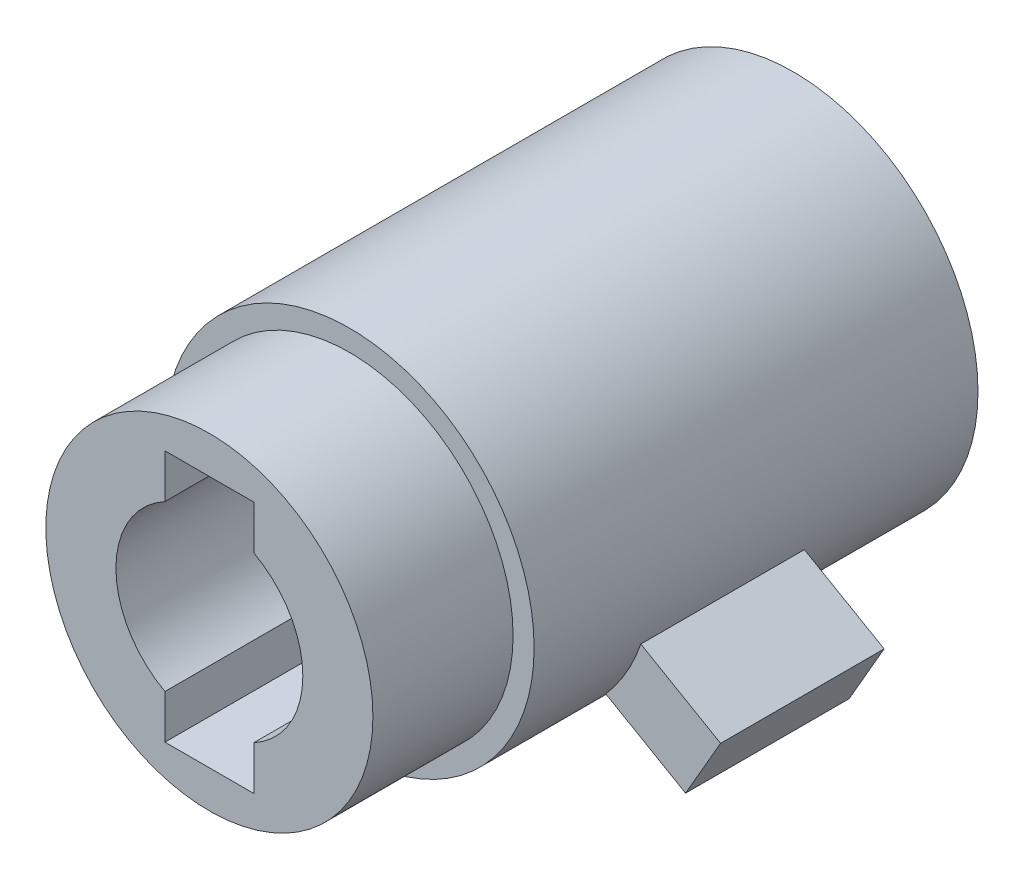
ISO-10303-21;
HEADER;
FILE_DESCRIPTION(('STEP AP214'),'2;1');
FILE_NAME('part.step','',(''),(''),'','','');
FILE_SCHEMA(('AUTOMOTIVE_DESIGN { 1 0 10303 214 1 1 1 1 }'));
ENDSEC;
DATA;
#1=APPLICATION_CONTEXT('core data for automotive mechanical design processes');
#2=APPLICATION_PROTOCOL_DEFINITION('international standard','automotive_design',2000,#1);
#3=PRODUCT_CONTEXT('',#1,'mechanical');
#4=PRODUCT('Part','Part','',(#3));
#5=PRODUCT_RELATED_PRODUCT_CATEGORY('part','',(#4));
#6=PRODUCT_DEFINITION_FORMATION('','',#4);
#7=PRODUCT_DEFINITION_CONTEXT('part definition',#1,'design');
#8=PRODUCT_DEFINITION('design','',#6,#7);
#9=PRODUCT_DEFINITION_SHAPE('','',#8);
#10=(LENGTH_UNIT() NAMED_UNIT(*) SI_UNIT(.MILLI.,.METRE.));
#11=(NAMED_UNIT(*) PLANE_ANGLE_UNIT() SI_UNIT($,.RADIAN.));
#12=(NAMED_UNIT(*) SI_UNIT($,.STERADIAN.) SOLID_ANGLE_UNIT());
#13=UNCERTAINTY_MEASURE_WITH_UNIT(LENGTH_MEASURE(1.E-05),#10,'distance_accuracy_value','');
#14=(GEOMETRIC_REPRESENTATION_CONTEXT(3) GLOBAL_UNCERTAINTY_ASSIGNED_CONTEXT((#13)) GLOBAL_UNIT_ASSIGNED_CONTEXT((#10,
#11,#12)) REPRESENTATION_CONTEXT('',''));
#15=CARTESIAN_POINT('',(0.,0.,0.));
#16=DIRECTION('',(0.,0.,1.));
#17=DIRECTION('',(1.,0.,0.));
#18=AXIS2_PLACEMENT_3D('',#15,#16,#17);
#19=CARTESIAN_POINT('',(0.,0.,-3.3));
#20=DIRECTION('',(0.,0.,1.));
#21=DIRECTION('',(1.,0.,0.));
#22=AXIS2_PLACEMENT_3D('',#19,#20,#21);
#23=CYLINDRICAL_SURFACE('',#22,3.95);
#24=DIRECTION('',(0.,0.,1.));
#25=VECTOR('',#24,1.);
#26=CARTESIAN_POINT('',(-3.73357112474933,-1.28955289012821,3.1));
#27=LINE('',#26,#25);
#28=CARTESIAN_POINT('',(-3.73357112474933,-1.28955289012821,3.1));
#29=VERTEX_POINT('',#28);
#30=CARTESIAN_POINT('',(-3.73357112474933,-1.28955289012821,6.2));
#31=VERTEX_POINT('',#30);
#32=EDGE_CURVE('E205',#29,#31,#27,.T.);
#33=ORIENTED_EDGE('',*,*,#32,.T.);
#34=CARTESIAN_POINT('',(0.,0.,6.2));
#35=DIRECTION('',(0.,0.,1.));
#36=DIRECTION('',(1.,0.,0.));
#37=AXIS2_PLACEMENT_3D('',#34,#35,#36);
#38=CIRCLE('',#37,3.95);
#39=CARTESIAN_POINT('',(-2.98357112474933,-2.58859099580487,6.2));
#40=VERTEX_POINT('',#39);
#41=EDGE_CURVE('E246',#40,#31,#38,.T.);
#42=ORIENTED_EDGE('',*,*,#41,.F.);
#43=DIRECTION('',(0.,0.,1.));
#44=VECTOR('',#43,1.);
#45=CARTESIAN_POINT('',(-2.98357112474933,-2.58859099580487,3.1));
#46=LINE('',#45,#44);
#47=CARTESIAN_POINT('',(-2.98357112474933,-2.58859099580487,3.1));
#48=VERTEX_POINT('',#47);
#49=EDGE_CURVE('E181',#48,#40,#46,.T.);
#50=ORIENTED_EDGE('',*,*,#49,.F.);
#51=CARTESIAN_POINT('',(0.,0.,3.1));
#52=DIRECTION('',(0.,0.,-1.));
#53=DIRECTION('',(1.,0.,0.));
#54=AXIS2_PLACEMENT_3D('',#51,#52,#53);
#55=CIRCLE('',#54,3.95);
#56=EDGE_CURVE('E197',#48,#29,#55,.T.);
#57=ORIENTED_EDGE('',*,*,#56,.T.);
#58=EDGE_LOOP('',(#33,#42,#50,#57));
#59=FACE_BOUND('',#58,.T.);
#60=CARTESIAN_POINT('',(0.,0.,-3.3));
#61=DIRECTION('',(0.,0.,1.));
#62=DIRECTION('',(1.,0.,0.));
#63=AXIS2_PLACEMENT_3D('',#60,#61,#62);
#64=CIRCLE('',#63,3.95);
#65=CARTESIAN_POINT('',(3.95,0.,-3.3));
#66=VERTEX_POINT('',#65);
#67=EDGE_CURVE('E248',#66,#66,#64,.T.);
#68=ORIENTED_EDGE('',*,*,#67,.T.);
#69=EDGE_LOOP('',(#68));
#70=FACE_BOUND('',#69,.T.);
#71=DIRECTION('',(0.,0.,1.));
#72=VECTOR('',#71,1.);
#73=CARTESIAN_POINT('',(3.73357112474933,-1.28955289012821,0.2));
#74=LINE('',#73,#72);
#75=CARTESIAN_POINT('',(3.73357112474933,-1.28955289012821,0.2));
#76=VERTEX_POINT('',#75);
#77=CARTESIAN_POINT('',(3.73357112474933,-1.28955289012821,3.7));
#78=VERTEX_POINT('',#77);
#79=EDGE_CURVE('E50',#76,#78,#74,.T.);
#80=ORIENTED_EDGE('',*,*,#79,.F.);
#81=CARTESIAN_POINT('',(0.,0.,0.2));
#82=DIRECTION('',(0.,0.,-1.));
#83=DIRECTION('',(1.,0.,0.));
#84=AXIS2_PLACEMENT_3D('',#81,#82,#83);
#85=CIRCLE('',#84,3.95);
#86=CARTESIAN_POINT('',(2.98357112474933,-2.58859099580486,0.2));
#87=VERTEX_POINT('',#86);
#88=EDGE_CURVE('E220',#76,#87,#85,.T.);
#89=ORIENTED_EDGE('',*,*,#88,.T.);
#90=DIRECTION('',(0.,0.,1.));
#91=VECTOR('',#90,1.);
#92=CARTESIAN_POINT('',(2.98357112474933,-2.58859099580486,0.2));
#93=LINE('',#92,#91);
#94=CARTESIAN_POINT('',(2.98357112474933,-2.58859099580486,3.7));
#95=VERTEX_POINT('',#94);
#96=EDGE_CURVE('E231',#87,#95,#93,.T.);
#97=ORIENTED_EDGE('',*,*,#96,.T.);
#98=CARTESIAN_POINT('',(0.,0.,3.7));
#99=DIRECTION('',(0.,0.,-1.));
#100=DIRECTION('',(1.,0.,0.));
#101=AXIS2_PLACEMENT_3D('',#98,#99,#100);
#102=CIRCLE('',#101,3.95);
#103=EDGE_CURVE('E204',#78,#95,#102,.T.);
#104=ORIENTED_EDGE('',*,*,#103,.F.);
#105=EDGE_LOOP('',(#80,#89,#97,#104));
#106=FACE_BOUND('',#105,.T.);
#107=ADVANCED_FACE('F27',(#59,#70,#106),#23,.T.);
#108=CARTESIAN_POINT('',(0.,0.,0.));
#109=DIRECTION('',(0.,0.,1.));
#110=DIRECTION('',(1.,0.,0.));
#111=AXIS2_PLACEMENT_3D('',#108,#109,#110);
#112=PLANE('',#111);
#113=CARTESIAN_POINT('',(0.,0.,0.));
#114=DIRECTION('',(0.,0.,1.));
#115=DIRECTION('',(1.,0.,0.));
#116=AXIS2_PLACEMENT_3D('',#113,#114,#115);
#117=CIRCLE('',#116,2.7);
#118=CARTESIAN_POINT('',(-0.95,2.52735039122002,0.));
#119=VERTEX_POINT('',#118);
#120=CARTESIAN_POINT('',(-0.95,-2.52735039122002,0.));
#121=VERTEX_POINT('',#120);
#122=EDGE_CURVE('E254',#119,#121,#117,.T.);
#123=ORIENTED_EDGE('',*,*,#122,.F.);
#124=DIRECTION('',(0.,-1.,0.));
#125=VECTOR('',#124,1.);
#126=CARTESIAN_POINT('',(-0.95,2.7,0.));
#127=LINE('',#126,#125);
#128=CARTESIAN_POINT('',(-0.95,1.7599715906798,0.));
#129=VERTEX_POINT('',#128);
#130=EDGE_CURVE('E281',#119,#129,#127,.T.);
#131=ORIENTED_EDGE('',*,*,#130,.T.);
#132=CARTESIAN_POINT('',(0.,0.,0.));
#133=DIRECTION('',(0.,0.,1.));
#134=DIRECTION('',(1.,0.,0.));
#135=AXIS2_PLACEMENT_3D('',#132,#133,#134);
#136=CIRCLE('',#135,2.);
#137=CARTESIAN_POINT('',(-0.95,-1.7599715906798,0.));
#138=VERTEX_POINT('',#137);
#139=EDGE_CURVE('E283',#129,#138,#136,.T.);
#140=ORIENTED_EDGE('',*,*,#139,.T.);
#141=DIRECTION('',(0.,-1.,0.));
#142=VECTOR('',#141,1.);
#143=CARTESIAN_POINT('',(-0.95,-2.7,0.));
#144=LINE('',#143,#142);
#145=EDGE_CURVE('E286',#138,#121,#144,.T.);
#146=ORIENTED_EDGE('',*,*,#145,.T.);
#147=EDGE_LOOP('',(#123,#131,#140,#146));
#148=FACE_BOUND('',#147,.T.);
#149=ADVANCED_FACE('F405',(#148),#112,.F.);
#150=CARTESIAN_POINT('',(0.95,-2.52735039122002,0.));
#151=VERTEX_POINT('',#150);
#152=CARTESIAN_POINT('',(0.95,2.52735039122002,0.));
#153=VERTEX_POINT('',#152);
#154=EDGE_CURVE('E251',#151,#153,#117,.T.);
#155=ORIENTED_EDGE('',*,*,#154,.F.);
#156=DIRECTION('',(0.,1.,0.));
#157=VECTOR('',#156,1.);
#158=CARTESIAN_POINT('',(0.95,-2.7,0.));
#159=LINE('',#158,#157);
#160=CARTESIAN_POINT('',(0.95,-1.7599715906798,0.));
#161=VERTEX_POINT('',#160);
#162=EDGE_CURVE('E289',#151,#161,#159,.T.);
#163=ORIENTED_EDGE('',*,*,#162,.T.);
#164=CARTESIAN_POINT('',(0.,0.,0.));
#165=DIRECTION('',(0.,0.,1.));
#166=DIRECTION('',(1.,0.,0.));
#167=AXIS2_PLACEMENT_3D('',#164,#165,#166);
#168=CIRCLE('',#167,2.);
#169=CARTESIAN_POINT('',(0.95,1.7599715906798,0.));
#170=VERTEX_POINT('',#169);
#171=EDGE_CURVE('E291',#161,#170,#168,.T.);
#172=ORIENTED_EDGE('',*,*,#171,.T.);
#173=DIRECTION('',(0.,1.,0.));
#174=VECTOR('',#173,1.);
#175=CARTESIAN_POINT('',(0.95,2.7,0.));
#176=LINE('',#175,#174);
#177=EDGE_CURVE('E278',#170,#153,#176,.T.);
#178=ORIENTED_EDGE('',*,*,#177,.T.);
#179=EDGE_LOOP('',(#155,#163,#172,#178));
#180=FACE_BOUND('',#179,.T.);
#181=ADVANCED_FACE('F349',(#180),#112,.F.);
#182=CARTESIAN_POINT('',(0.,0.,9.2));
#183=DIRECTION('',(0.,0.,1.));
#184=DIRECTION('',(1.,0.,0.));
#185=AXIS2_PLACEMENT_3D('',#182,#183,#184);
#186=PLANE('',#185);
#187=CARTESIAN_POINT('',(0.,0.,9.2));
#188=DIRECTION('',(0.,0.,1.));
#189=DIRECTION('',(1.,0.,0.));
#190=AXIS2_PLACEMENT_3D('',#187,#188,#189);
#191=CIRCLE('',#190,3.5);
#192=CARTESIAN_POINT('',(3.5,0.,9.2));
#193=VERTEX_POINT('',#192);
#194=EDGE_CURVE('E334',#193,#193,#191,.T.);
#195=ORIENTED_EDGE('',*,*,#194,.T.);
#196=EDGE_LOOP('',(#195));
#197=FACE_BOUND('',#196,.T.);
#198=DIRECTION('',(-1.,0.,0.));
#199=VECTOR('',#198,1.);
#200=CARTESIAN_POINT('',(-0.95,2.7,9.2));
#201=LINE('',#200,#199);
#202=CARTESIAN_POINT('',(0.95,2.7,9.2));
#203=VERTEX_POINT('',#202);
#204=CARTESIAN_POINT('',(-0.95,2.7,9.2));
#205=VERTEX_POINT('',#204);
#206=EDGE_CURVE('E296',#203,#205,#201,.T.);
#207=ORIENTED_EDGE('',*,*,#206,.F.);
#208=DIRECTION('',(0.,1.,0.));
#209=VECTOR('',#208,1.);
#210=CARTESIAN_POINT('',(0.95,2.7,9.2));
#211=LINE('',#210,#209);
#212=CARTESIAN_POINT('',(0.95,1.7599715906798,9.2));
#213=VERTEX_POINT('',#212);
#214=EDGE_CURVE('E294',#213,#203,#211,.T.);
#215=ORIENTED_EDGE('',*,*,#214,.F.);
#216=CARTESIAN_POINT('',(0.,0.,9.2));
#217=DIRECTION('',(0.,0.,1.));
#218=DIRECTION('',(1.,0.,0.));
#219=AXIS2_PLACEMENT_3D('',#216,#217,#218);
#220=CIRCLE('',#219,2.);
#221=CARTESIAN_POINT('',(0.95,-1.7599715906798,9.2));
#222=VERTEX_POINT('',#221);
#223=EDGE_CURVE('E309',#222,#213,#220,.T.);
#224=ORIENTED_EDGE('',*,*,#223,.F.);
#225=DIRECTION('',(0.,1.,0.));
#226=VECTOR('',#225,1.);
#227=CARTESIAN_POINT('',(0.95,-2.7,9.2));
#228=LINE('',#227,#226);
#229=CARTESIAN_POINT('',(0.95,-2.7,9.2));
#230=VERTEX_POINT('',#229);
#231=EDGE_CURVE('E306',#230,#222,#228,.T.);
#232=ORIENTED_EDGE('',*,*,#231,.F.);
#233=DIRECTION('',(1.,0.,0.));
#234=VECTOR('',#233,1.);
#235=CARTESIAN_POINT('',(-0.95,-2.7,9.2));
#236=LINE('',#235,#234);
#237=CARTESIAN_POINT('',(-0.95,-2.7,9.2));
#238=VERTEX_POINT('',#237);
#239=EDGE_CURVE('E304',#238,#230,#236,.T.);
#240=ORIENTED_EDGE('',*,*,#239,.F.);
#241=DIRECTION('',(0.,-1.,0.));
#242=VECTOR('',#241,1.);
#243=CARTESIAN_POINT('',(-0.95,-2.7,9.2));
#244=LINE('',#243,#242);
#245=CARTESIAN_POINT('',(-0.95,-1.7599715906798,9.2));
#246=VERTEX_POINT('',#245);
#247=EDGE_CURVE('E302',#246,#238,#244,.T.);
#248=ORIENTED_EDGE('',*,*,#247,.F.);
#249=CARTESIAN_POINT('',(0.,0.,9.2));
#250=DIRECTION('',(0.,0.,1.));
#251=DIRECTION('',(1.,0.,0.));
#252=AXIS2_PLACEMENT_3D('',#249,#250,#251);
#253=CIRCLE('',#252,2.);
#254=CARTESIAN_POINT('',(-0.95,1.7599715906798,9.2));
#255=VERTEX_POINT('',#254);
#256=EDGE_CURVE('E300',#255,#246,#253,.T.);
#257=ORIENTED_EDGE('',*,*,#256,.F.);
#258=DIRECTION('',(0.,-1.,0.));
#259=VECTOR('',#258,1.);
#260=CARTESIAN_POINT('',(-0.95,2.7,9.2));
#261=LINE('',#260,#259);
#262=EDGE_CURVE('E298',#205,#255,#261,.T.);
#263=ORIENTED_EDGE('',*,*,#262,.F.);
#264=EDGE_LOOP('',(#207,#215,#224,#232,#240,#248,#257,#263));
#265=FACE_BOUND('',#264,.T.);
#266=ADVANCED_FACE('F362',(#197,#265),#186,.T.);
#267=CARTESIAN_POINT('',(0.,0.,9.2));
#268=DIRECTION('',(0.,0.,-1.));
#269=DIRECTION('',(-1.,0.,0.));
#270=AXIS2_PLACEMENT_3D('',#267,#268,#269);
#271=CYLINDRICAL_SURFACE('',#270,3.5);
#272=CARTESIAN_POINT('',(0.,0.,6.2));
#273=DIRECTION('',(0.,0.,1.));
#274=DIRECTION('',(1.,0.,0.));
#275=AXIS2_PLACEMENT_3D('',#272,#273,#274);
#276=CIRCLE('',#275,3.5);
#277=CARTESIAN_POINT('',(3.5,0.,6.2));
#278=VERTEX_POINT('',#277);
#279=EDGE_CURVE('E275',#278,#278,#276,.T.);
#280=ORIENTED_EDGE('',*,*,#279,.T.);
#281=EDGE_LOOP('',(#280));
#282=FACE_BOUND('',#281,.T.);
#283=ORIENTED_EDGE('',*,*,#194,.F.);
#284=EDGE_LOOP('',(#283));
#285=FACE_BOUND('',#284,.T.);
#286=ADVANCED_FACE('F29',(#282,#285),#271,.T.);
#287=CARTESIAN_POINT('',(0.95,2.7,9.2));
#288=DIRECTION('',(-1.,0.,0.));
#289=DIRECTION('',(0.,0.,1.));
#290=AXIS2_PLACEMENT_3D('',#287,#288,#289);
#291=PLANE('',#290);
#292=DIRECTION('',(0.,1.,0.));
#293=VECTOR('',#292,1.);
#294=CARTESIAN_POINT('',(0.95,2.7,6.2));
#295=LINE('',#294,#293);
#296=CARTESIAN_POINT('',(0.95,2.52735039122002,6.2));
#297=VERTEX_POINT('',#296);
#298=CARTESIAN_POINT('',(0.95,2.7,6.2));
#299=VERTEX_POINT('',#298);
#300=EDGE_CURVE('E273',#297,#299,#295,.T.);
#301=ORIENTED_EDGE('',*,*,#300,.F.);
#302=DIRECTION('',(0.,0.,1.));
#303=VECTOR('',#302,1.);
#304=CARTESIAN_POINT('',(0.95,2.52735039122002,-3.3));
#305=LINE('',#304,#303);
#306=EDGE_CURVE('E253',#297,#153,#305,.F.);
#307=ORIENTED_EDGE('',*,*,#306,.T.);
#308=ORIENTED_EDGE('',*,*,#177,.F.);
#309=DIRECTION('',(0.,0.,-1.));
#310=VECTOR('',#309,1.);
#311=CARTESIAN_POINT('',(0.95,1.7599715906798,9.2));
#312=LINE('',#311,#310);
#313=EDGE_CURVE('E311',#213,#170,#312,.T.);
#314=ORIENTED_EDGE('',*,*,#313,.F.);
#315=ORIENTED_EDGE('',*,*,#214,.T.);
#316=DIRECTION('',(0.,0.,-1.));
#317=VECTOR('',#316,1.);
#318=CARTESIAN_POINT('',(0.95,2.7,9.2));
#319=LINE('',#318,#317);
#320=EDGE_CURVE('E331',#203,#299,#319,.T.);
#321=ORIENTED_EDGE('',*,*,#320,.T.);
#322=EDGE_LOOP('',(#301,#307,#308,#314,#315,#321));
#323=FACE_BOUND('',#322,.T.);
#324=ADVANCED_FACE('F354',(#323),#291,.T.);
#325=CARTESIAN_POINT('',(-0.95,2.7,9.2));
#326=DIRECTION('',(0.,-1.,0.));
#327=DIRECTION('',(0.,0.,-1.));
#328=AXIS2_PLACEMENT_3D('',#325,#326,#327);
#329=PLANE('',#328);
#330=DIRECTION('',(-1.,0.,0.));
#331=VECTOR('',#330,1.);
#332=CARTESIAN_POINT('',(-0.95,2.7,6.2));
#333=LINE('',#332,#331);
#334=CARTESIAN_POINT('',(0.,2.7,6.2));
#335=VERTEX_POINT('',#334);
#336=EDGE_CURVE('E272',#299,#335,#333,.T.);
#337=ORIENTED_EDGE('',*,*,#336,.F.);
#338=ORIENTED_EDGE('',*,*,#320,.F.);
#339=ORIENTED_EDGE('',*,*,#206,.T.);
#340=DIRECTION('',(0.,0.,-1.));
#341=VECTOR('',#340,1.);
#342=CARTESIAN_POINT('',(-0.95,2.7,9.2));
#343=LINE('',#342,#341);
#344=CARTESIAN_POINT('',(-0.95,2.7,6.2));
#345=VERTEX_POINT('',#344);
#346=EDGE_CURVE('E328',#205,#345,#343,.T.);
#347=ORIENTED_EDGE('',*,*,#346,.T.);
#348=EDGE_CURVE('E270',#335,#345,#333,.T.);
#349=ORIENTED_EDGE('',*,*,#348,.F.);
#350=EDGE_LOOP('',(#337,#338,#339,#347,#349));
#351=FACE_BOUND('',#350,.T.);
#352=ADVANCED_FACE('F368',(#351),#329,.T.);
#353=CARTESIAN_POINT('',(-0.95,2.7,9.2));
#354=DIRECTION('',(1.,0.,0.));
#355=DIRECTION('',(0.,0.,-1.));
#356=AXIS2_PLACEMENT_3D('',#353,#354,#355);
#357=PLANE('',#356);
#358=DIRECTION('',(0.,-1.,0.));
#359=VECTOR('',#358,1.);
#360=CARTESIAN_POINT('',(-0.95,2.7,6.2));
#361=LINE('',#360,#359);
#362=CARTESIAN_POINT('',(-0.95,2.52735039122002,6.2));
#363=VERTEX_POINT('',#362);
#364=EDGE_CURVE('E268',#345,#363,#361,.T.);
#365=ORIENTED_EDGE('',*,*,#364,.F.);
#366=ORIENTED_EDGE('',*,*,#346,.F.);
#367=ORIENTED_EDGE('',*,*,#262,.T.);
#368=DIRECTION('',(0.,0.,-1.));
#369=VECTOR('',#368,1.);
#370=CARTESIAN_POINT('',(-0.95,1.7599715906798,9.2));
#371=LINE('',#370,#369);
#372=EDGE_CURVE('E325',#255,#129,#371,.T.);
#373=ORIENTED_EDGE('',*,*,#372,.T.);
#374=ORIENTED_EDGE('',*,*,#130,.F.);
#375=DIRECTION('',(0.,0.,1.));
#376=VECTOR('',#375,1.);
#377=CARTESIAN_POINT('',(-0.95,2.52735039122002,-3.3));
#378=LINE('',#377,#376);
#379=EDGE_CURVE('E260',#119,#363,#378,.T.);
#380=ORIENTED_EDGE('',*,*,#379,.T.);
#381=EDGE_LOOP('',(#365,#366,#367,#373,#374,#380));
#382=FACE_BOUND('',#381,.T.);
#383=ADVANCED_FACE('F429',(#382),#357,.T.);
#384=CARTESIAN_POINT('',(0.,0.,9.2));
#385=DIRECTION('',(0.,0.,-1.));
#386=DIRECTION('',(-1.,0.,0.));
#387=AXIS2_PLACEMENT_3D('',#384,#385,#386);
#388=CYLINDRICAL_SURFACE('',#387,2.);
#389=ORIENTED_EDGE('',*,*,#139,.F.);
#390=ORIENTED_EDGE('',*,*,#372,.F.);
#391=ORIENTED_EDGE('',*,*,#256,.T.);
#392=DIRECTION('',(0.,0.,-1.));
#393=VECTOR('',#392,1.);
#394=CARTESIAN_POINT('',(-0.95,-1.7599715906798,9.2));
#395=LINE('',#394,#393);
#396=EDGE_CURVE('E323',#246,#138,#395,.T.);
#397=ORIENTED_EDGE('',*,*,#396,.T.);
#398=EDGE_LOOP('',(#389,#390,#391,#397));
#399=FACE_BOUND('',#398,.T.);
#400=ADVANCED_FACE('F425',(#399),#388,.F.);
#401=CARTESIAN_POINT('',(-0.95,-2.7,9.2));
#402=DIRECTION('',(1.,0.,0.));
#403=DIRECTION('',(0.,0.,-1.));
#404=AXIS2_PLACEMENT_3D('',#401,#402,#403);
#405=PLANE('',#404);
#406=DIRECTION('',(0.,-1.,0.));
#407=VECTOR('',#406,1.);
#408=CARTESIAN_POINT('',(-0.95,-2.7,6.2));
#409=LINE('',#408,#407);
#410=CARTESIAN_POINT('',(-0.95,-2.52735039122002,6.2));
#411=VERTEX_POINT('',#410);
#412=CARTESIAN_POINT('',(-0.95,-2.7,6.2));
#413=VERTEX_POINT('',#412);
#414=EDGE_CURVE('E266',#411,#413,#409,.T.);
#415=ORIENTED_EDGE('',*,*,#414,.F.);
#416=DIRECTION('',(0.,0.,1.));
#417=VECTOR('',#416,1.);
#418=CARTESIAN_POINT('',(-0.95,-2.52735039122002,-3.3));
#419=LINE('',#418,#417);
#420=EDGE_CURVE('E257',#411,#121,#419,.F.);
#421=ORIENTED_EDGE('',*,*,#420,.T.);
#422=ORIENTED_EDGE('',*,*,#145,.F.);
#423=ORIENTED_EDGE('',*,*,#396,.F.);
#424=ORIENTED_EDGE('',*,*,#247,.T.);
#425=DIRECTION('',(0.,0.,-1.));
#426=VECTOR('',#425,1.);
#427=CARTESIAN_POINT('',(-0.95,-2.7,9.2));
#428=LINE('',#427,#426);
#429=EDGE_CURVE('E320',#238,#413,#428,.T.);
#430=ORIENTED_EDGE('',*,*,#429,.T.);
#431=EDGE_LOOP('',(#415,#421,#422,#423,#424,#430));
#432=FACE_BOUND('',#431,.T.);
#433=ADVANCED_FACE('F422',(#432),#405,.T.);
#434=CARTESIAN_POINT('',(-0.95,-2.7,9.2));
#435=DIRECTION('',(0.,1.,0.));
#436=DIRECTION('',(0.,0.,1.));
#437=AXIS2_PLACEMENT_3D('',#434,#435,#436);
#438=PLANE('',#437);
#439=DIRECTION('',(1.,0.,0.));
#440=VECTOR('',#439,1.);
#441=CARTESIAN_POINT('',(-0.95,-2.7,6.2));
#442=LINE('',#441,#440);
#443=CARTESIAN_POINT('',(0.,-2.7,6.2));
#444=VERTEX_POINT('',#443);
#445=EDGE_CURVE('E265',#413,#444,#442,.T.);
#446=ORIENTED_EDGE('',*,*,#445,.F.);
#447=ORIENTED_EDGE('',*,*,#429,.F.);
#448=ORIENTED_EDGE('',*,*,#239,.T.);
#449=DIRECTION('',(0.,0.,-1.));
#450=VECTOR('',#449,1.);
#451=CARTESIAN_POINT('',(0.95,-2.7,9.2));
#452=LINE('',#451,#450);
#453=CARTESIAN_POINT('',(0.95,-2.7,6.2));
#454=VERTEX_POINT('',#453);
#455=EDGE_CURVE('E317',#230,#454,#452,.T.);
#456=ORIENTED_EDGE('',*,*,#455,.T.);
#457=EDGE_CURVE('E263',#444,#454,#442,.T.);
#458=ORIENTED_EDGE('',*,*,#457,.F.);
#459=EDGE_LOOP('',(#446,#447,#448,#456,#458));
#460=FACE_BOUND('',#459,.T.);
#461=ADVANCED_FACE('F386',(#460),#438,.T.);
#462=CARTESIAN_POINT('',(0.95,-2.7,9.2));
#463=DIRECTION('',(-1.,0.,0.));
#464=DIRECTION('',(0.,0.,1.));
#465=AXIS2_PLACEMENT_3D('',#462,#463,#464);
#466=PLANE('',#465);
#467=DIRECTION('',(0.,1.,0.));
#468=VECTOR('',#467,1.);
#469=CARTESIAN_POINT('',(0.95,-2.7,6.2));
#470=LINE('',#469,#468);
#471=CARTESIAN_POINT('',(0.95,-2.52735039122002,6.2));
#472=VERTEX_POINT('',#471);
#473=EDGE_CURVE('E11',#454,#472,#470,.T.);
#474=ORIENTED_EDGE('',*,*,#473,.F.);
#475=ORIENTED_EDGE('',*,*,#455,.F.);
#476=ORIENTED_EDGE('',*,*,#231,.T.);
#477=DIRECTION('',(0.,0.,-1.));
#478=VECTOR('',#477,1.);
#479=CARTESIAN_POINT('',(0.95,-1.7599715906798,9.2));
#480=LINE('',#479,#478);
#481=EDGE_CURVE('E314',#222,#161,#480,.T.);
#482=ORIENTED_EDGE('',*,*,#481,.T.);
#483=ORIENTED_EDGE('',*,*,#162,.F.);
#484=DIRECTION('',(0.,0.,1.));
#485=VECTOR('',#484,1.);
#486=CARTESIAN_POINT('',(0.95,-2.52735039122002,-3.3));
#487=LINE('',#486,#485);
#488=EDGE_CURVE('E35',#151,#472,#487,.T.);
#489=ORIENTED_EDGE('',*,*,#488,.T.);
#490=EDGE_LOOP('',(#474,#475,#476,#482,#483,#489));
#491=FACE_BOUND('',#490,.T.);
#492=ADVANCED_FACE('F340',(#491),#466,.T.);
#493=CARTESIAN_POINT('',(0.,0.,9.2));
#494=DIRECTION('',(0.,0.,-1.));
#495=DIRECTION('',(-1.,0.,0.));
#496=AXIS2_PLACEMENT_3D('',#493,#494,#495);
#497=CYLINDRICAL_SURFACE('',#496,2.);
#498=ORIENTED_EDGE('',*,*,#171,.F.);
#499=ORIENTED_EDGE('',*,*,#481,.F.);
#500=ORIENTED_EDGE('',*,*,#223,.T.);
#501=ORIENTED_EDGE('',*,*,#313,.T.);
#502=EDGE_LOOP('',(#498,#499,#500,#501));
#503=FACE_BOUND('',#502,.T.);
#504=ADVANCED_FACE('F357',(#503),#497,.F.);
#505=CARTESIAN_POINT('',(0.,0.,6.2));
#506=DIRECTION('',(0.,0.,1.));
#507=DIRECTION('',(1.,0.,0.));
#508=AXIS2_PLACEMENT_3D('',#505,#506,#507);
#509=PLANE('',#508);
#510=ORIENTED_EDGE('',*,*,#41,.T.);
#511=DIRECTION('',(-0.866025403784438,-0.500000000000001,0.));
#512=VECTOR('',#511,1.);
#513=CARTESIAN_POINT('',(-5.44124861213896,-2.27548094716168,6.2));
#514=LINE('',#513,#512);
#515=CARTESIAN_POINT('',(-5.44124861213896,-2.27548094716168,6.2));
#516=VERTEX_POINT('',#515);
#517=EDGE_CURVE('E187',#31,#516,#514,.T.);
#518=ORIENTED_EDGE('',*,*,#517,.T.);
#519=DIRECTION('',(0.500000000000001,-0.866025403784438,0.));
#520=VECTOR('',#519,1.);
#521=CARTESIAN_POINT('',(-5.44124861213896,-2.27548094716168,6.2));
#522=LINE('',#521,#520);
#523=CARTESIAN_POINT('',(-4.69124861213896,-3.57451905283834,6.2));
#524=VERTEX_POINT('',#523);
#525=EDGE_CURVE('E174',#516,#524,#522,.T.);
#526=ORIENTED_EDGE('',*,*,#525,.T.);
#527=DIRECTION('',(0.866025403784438,0.500000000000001,0.));
#528=VECTOR('',#527,1.);
#529=CARTESIAN_POINT('',(-4.69124861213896,-3.57451905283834,6.2));
#530=LINE('',#529,#528);
#531=EDGE_CURVE('E42',#524,#40,#530,.T.);
#532=ORIENTED_EDGE('',*,*,#531,.T.);
#533=EDGE_LOOP('',(#510,#518,#526,#532));
#534=FACE_BOUND('',#533,.T.);
#535=ORIENTED_EDGE('',*,*,#279,.F.);
#536=EDGE_LOOP('',(#535));
#537=FACE_BOUND('',#536,.T.);
#538=ADVANCED_FACE('F189',(#534,#537),#509,.T.);
#539=CARTESIAN_POINT('',(0.,0.,6.2));
#540=DIRECTION('',(0.,0.,1.));
#541=DIRECTION('',(1.,0.,0.));
#542=AXIS2_PLACEMENT_3D('',#539,#540,#541);
#543=CIRCLE('',#542,2.7);
#544=EDGE_CURVE('E239',#297,#335,#543,.T.);
#545=ORIENTED_EDGE('',*,*,#544,.F.);
#546=ORIENTED_EDGE('',*,*,#300,.T.);
#547=ORIENTED_EDGE('',*,*,#336,.T.);
#548=EDGE_LOOP('',(#545,#546,#547));
#549=FACE_BOUND('',#548,.T.);
#550=ADVANCED_FACE('F374',(#549),#509,.T.);
#551=EDGE_CURVE('E243',#335,#363,#543,.T.);
#552=ORIENTED_EDGE('',*,*,#551,.F.);
#553=ORIENTED_EDGE('',*,*,#348,.T.);
#554=ORIENTED_EDGE('',*,*,#364,.T.);
#555=EDGE_LOOP('',(#552,#553,#554));
#556=FACE_BOUND('',#555,.T.);
#557=ADVANCED_FACE('F377',(#556),#509,.T.);
#558=EDGE_CURVE('E379',#411,#444,#543,.T.);
#559=ORIENTED_EDGE('',*,*,#558,.F.);
#560=ORIENTED_EDGE('',*,*,#414,.T.);
#561=ORIENTED_EDGE('',*,*,#445,.T.);
#562=EDGE_LOOP('',(#559,#560,#561));
#563=FACE_BOUND('',#562,.T.);
#564=ADVANCED_FACE('F393',(#563),#509,.T.);
#565=CARTESIAN_POINT('',(0.,0.,-3.3));
#566=DIRECTION('',(0.,0.,1.));
#567=DIRECTION('',(1.,0.,0.));
#568=AXIS2_PLACEMENT_3D('',#565,#566,#567);
#569=PLANE('',#568);
#570=CARTESIAN_POINT('',(0.,0.,-3.3));
#571=DIRECTION('',(0.,0.,1.));
#572=DIRECTION('',(1.,0.,0.));
#573=AXIS2_PLACEMENT_3D('',#570,#571,#572);
#574=CIRCLE('',#573,2.7);
#575=CARTESIAN_POINT('',(2.7,0.,-3.3));
#576=VERTEX_POINT('',#575);
#577=EDGE_CURVE('E242',#576,#576,#574,.T.);
#578=ORIENTED_EDGE('',*,*,#577,.T.);
#579=EDGE_LOOP('',(#578));
#580=FACE_BOUND('',#579,.T.);
#581=ORIENTED_EDGE('',*,*,#67,.F.);
#582=EDGE_LOOP('',(#581));
#583=FACE_BOUND('',#582,.T.);
#584=ADVANCED_FACE('F391',(#580,#583),#569,.F.);
#585=EDGE_CURVE('E233',#444,#472,#543,.T.);
#586=ORIENTED_EDGE('',*,*,#585,.F.);
#587=ORIENTED_EDGE('',*,*,#457,.T.);
#588=ORIENTED_EDGE('',*,*,#473,.T.);
#589=EDGE_LOOP('',(#586,#587,#588));
#590=FACE_BOUND('',#589,.T.);
#591=ADVANCED_FACE('F389',(#590),#509,.T.);
#592=CARTESIAN_POINT('',(0.,0.,-3.3));
#593=DIRECTION('',(0.,0.,1.));
#594=DIRECTION('',(1.,0.,0.));
#595=AXIS2_PLACEMENT_3D('',#592,#593,#594);
#596=CYLINDRICAL_SURFACE('',#595,2.7);
#597=ORIENTED_EDGE('',*,*,#544,.T.);
#598=ORIENTED_EDGE('',*,*,#551,.T.);
#599=ORIENTED_EDGE('',*,*,#379,.F.);
#600=ORIENTED_EDGE('',*,*,#122,.T.);
#601=ORIENTED_EDGE('',*,*,#420,.F.);
#602=ORIENTED_EDGE('',*,*,#558,.T.);
#603=ORIENTED_EDGE('',*,*,#585,.T.);
#604=ORIENTED_EDGE('',*,*,#488,.F.);
#605=ORIENTED_EDGE('',*,*,#154,.T.);
#606=ORIENTED_EDGE('',*,*,#306,.F.);
#607=EDGE_LOOP('',(#597,#598,#599,#600,#601,#602,#603,#604,#605,#606));
#608=FACE_BOUND('',#607,.T.);
#609=ORIENTED_EDGE('',*,*,#577,.F.);
#610=EDGE_LOOP('',(#609));
#611=FACE_BOUND('',#610,.T.);
#612=ADVANCED_FACE('F344',(#608,#611),#596,.F.);
#613=CARTESIAN_POINT('',(5.44124861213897,-2.27548094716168,0.2));
#614=DIRECTION('',(0.500000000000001,0.866025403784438,0.));
#615=DIRECTION('',(-0.866025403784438,0.500000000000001,0.));
#616=AXIS2_PLACEMENT_3D('',#613,#614,#615);
#617=PLANE('',#616);
#618=DIRECTION('',(-0.866025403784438,0.500000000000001,0.));
#619=VECTOR('',#618,1.);
#620=CARTESIAN_POINT('',(5.44124861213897,-2.27548094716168,3.7));
#621=LINE('',#620,#619);
#622=CARTESIAN_POINT('',(5.44124861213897,-2.27548094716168,3.7));
#623=VERTEX_POINT('',#622);
#624=EDGE_CURVE('E217',#623,#78,#621,.T.);
#625=ORIENTED_EDGE('',*,*,#624,.F.);
#626=DIRECTION('',(0.,0.,1.));
#627=VECTOR('',#626,1.);
#628=CARTESIAN_POINT('',(5.44124861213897,-2.27548094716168,0.2));
#629=LINE('',#628,#627);
#630=CARTESIAN_POINT('',(5.44124861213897,-2.27548094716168,0.2));
#631=VERTEX_POINT('',#630);
#632=EDGE_CURVE('E234',#631,#623,#629,.T.);
#633=ORIENTED_EDGE('',*,*,#632,.F.);
#634=DIRECTION('',(-0.866025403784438,0.500000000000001,0.));
#635=VECTOR('',#634,1.);
#636=CARTESIAN_POINT('',(5.44124861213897,-2.27548094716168,0.2));
#637=LINE('',#636,#635);
#638=EDGE_CURVE('E228',#631,#76,#637,.T.);
#639=ORIENTED_EDGE('',*,*,#638,.T.);
#640=ORIENTED_EDGE('',*,*,#79,.T.);
#641=EDGE_LOOP('',(#625,#633,#639,#640));
#642=FACE_BOUND('',#641,.T.);
#643=ADVANCED_FACE('F398',(#642),#617,.T.);
#644=CARTESIAN_POINT('',(5.44124861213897,-2.27548094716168,0.2));
#645=DIRECTION('',(0.866025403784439,-0.499999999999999,0.));
#646=DIRECTION('',(0.499999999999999,0.866025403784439,0.));
#647=AXIS2_PLACEMENT_3D('',#644,#645,#646);
#648=PLANE('',#647);
#649=DIRECTION('',(0.499999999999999,0.866025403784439,0.));
#650=VECTOR('',#649,1.);
#651=CARTESIAN_POINT('',(5.44124861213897,-2.27548094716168,3.7));
#652=LINE('',#651,#650);
#653=CARTESIAN_POINT('',(4.69124861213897,-3.57451905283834,3.7));
#654=VERTEX_POINT('',#653);
#655=EDGE_CURVE('E214',#654,#623,#652,.T.);
#656=ORIENTED_EDGE('',*,*,#655,.F.);
#657=DIRECTION('',(0.,0.,1.));
#658=VECTOR('',#657,1.);
#659=CARTESIAN_POINT('',(4.69124861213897,-3.57451905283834,0.2));
#660=LINE('',#659,#658);
#661=CARTESIAN_POINT('',(4.69124861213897,-3.57451905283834,0.2));
#662=VERTEX_POINT('',#661);
#663=EDGE_CURVE('E236',#662,#654,#660,.T.);
#664=ORIENTED_EDGE('',*,*,#663,.F.);
#665=DIRECTION('',(0.499999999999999,0.866025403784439,0.));
#666=VECTOR('',#665,1.);
#667=CARTESIAN_POINT('',(5.44124861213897,-2.27548094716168,0.2));
#668=LINE('',#667,#666);
#669=EDGE_CURVE('E225',#662,#631,#668,.T.);
#670=ORIENTED_EDGE('',*,*,#669,.T.);
#671=ORIENTED_EDGE('',*,*,#632,.T.);
#672=EDGE_LOOP('',(#656,#664,#670,#671));
#673=FACE_BOUND('',#672,.T.);
#674=ADVANCED_FACE('F514',(#673),#648,.T.);
#675=CARTESIAN_POINT('',(4.69124861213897,-3.57451905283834,0.2));
#676=DIRECTION('',(-0.500000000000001,-0.866025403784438,0.));
#677=DIRECTION('',(0.866025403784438,-0.500000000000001,0.));
#678=AXIS2_PLACEMENT_3D('',#675,#676,#677);
#679=PLANE('',#678);
#680=DIRECTION('',(0.866025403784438,-0.500000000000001,0.));
#681=VECTOR('',#680,1.);
#682=CARTESIAN_POINT('',(4.69124861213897,-3.57451905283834,3.7));
#683=LINE('',#682,#681);
#684=EDGE_CURVE('E211',#95,#654,#683,.T.);
#685=ORIENTED_EDGE('',*,*,#684,.F.);
#686=ORIENTED_EDGE('',*,*,#96,.F.);
#687=DIRECTION('',(0.866025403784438,-0.500000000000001,0.));
#688=VECTOR('',#687,1.);
#689=CARTESIAN_POINT('',(4.69124861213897,-3.57451905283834,0.2));
#690=LINE('',#689,#688);
#691=EDGE_CURVE('E222',#87,#662,#690,.T.);
#692=ORIENTED_EDGE('',*,*,#691,.T.);
#693=ORIENTED_EDGE('',*,*,#663,.T.);
#694=EDGE_LOOP('',(#685,#686,#692,#693));
#695=FACE_BOUND('',#694,.T.);
#696=ADVANCED_FACE('F522',(#695),#679,.T.);
#697=CARTESIAN_POINT('',(0.,0.,0.2));
#698=DIRECTION('',(0.,0.,1.));
#699=DIRECTION('',(1.,0.,0.));
#700=AXIS2_PLACEMENT_3D('',#697,#698,#699);
#701=PLANE('',#700);
#702=ORIENTED_EDGE('',*,*,#88,.F.);
#703=ORIENTED_EDGE('',*,*,#638,.F.);
#704=ORIENTED_EDGE('',*,*,#669,.F.);
#705=ORIENTED_EDGE('',*,*,#691,.F.);
#706=EDGE_LOOP('',(#702,#703,#704,#705));
#707=FACE_BOUND('',#706,.T.);
#708=ADVANCED_FACE('F530',(#707),#701,.F.);
#709=CARTESIAN_POINT('',(0.,0.,3.7));
#710=DIRECTION('',(0.,0.,1.));
#711=DIRECTION('',(1.,0.,0.));
#712=AXIS2_PLACEMENT_3D('',#709,#710,#711);
#713=PLANE('',#712);
#714=ORIENTED_EDGE('',*,*,#103,.T.);
#715=ORIENTED_EDGE('',*,*,#684,.T.);
#716=ORIENTED_EDGE('',*,*,#655,.T.);
#717=ORIENTED_EDGE('',*,*,#624,.T.);
#718=EDGE_LOOP('',(#714,#715,#716,#717));
#719=FACE_BOUND('',#718,.T.);
#720=ADVANCED_FACE('F538',(#719),#713,.T.);
#721=CARTESIAN_POINT('',(-5.44124861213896,-2.27548094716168,3.1));
#722=DIRECTION('',(-0.866025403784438,-0.500000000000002,0.));
#723=DIRECTION('',(0.500000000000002,-0.866025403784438,0.));
#724=AXIS2_PLACEMENT_3D('',#721,#722,#723);
#725=PLANE('',#724);
#726=ORIENTED_EDGE('',*,*,#525,.F.);
#727=DIRECTION('',(0.,0.,1.));
#728=VECTOR('',#727,1.);
#729=CARTESIAN_POINT('',(-5.44124861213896,-2.27548094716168,3.1));
#730=LINE('',#729,#728);
#731=CARTESIAN_POINT('',(-5.44124861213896,-2.27548094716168,3.1));
#732=VERTEX_POINT('',#731);
#733=EDGE_CURVE('E202',#732,#516,#730,.T.);
#734=ORIENTED_EDGE('',*,*,#733,.F.);
#735=DIRECTION('',(0.500000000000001,-0.866025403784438,0.));
#736=VECTOR('',#735,1.);
#737=CARTESIAN_POINT('',(-5.44124861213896,-2.27548094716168,3.1));
#738=LINE('',#737,#736);
#739=CARTESIAN_POINT('',(-4.69124861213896,-3.57451905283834,3.1));
#740=VERTEX_POINT('',#739);
#741=EDGE_CURVE('E177',#732,#740,#738,.T.);
#742=ORIENTED_EDGE('',*,*,#741,.T.);
#743=DIRECTION('',(0.,0.,1.));
#744=VECTOR('',#743,1.);
#745=CARTESIAN_POINT('',(-4.69124861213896,-3.57451905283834,3.1));
#746=LINE('',#745,#744);
#747=EDGE_CURVE('E172',#740,#524,#746,.T.);
#748=ORIENTED_EDGE('',*,*,#747,.T.);
#749=EDGE_LOOP('',(#726,#734,#742,#748));
#750=FACE_BOUND('',#749,.T.);
#751=ADVANCED_FACE('F173',(#750),#725,.T.);
#752=CARTESIAN_POINT('',(-5.44124861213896,-2.27548094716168,3.1));
#753=DIRECTION('',(-0.500000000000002,0.866025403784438,0.));
#754=DIRECTION('',(-0.866025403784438,-0.500000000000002,0.));
#755=AXIS2_PLACEMENT_3D('',#752,#753,#754);
#756=PLANE('',#755);
#757=ORIENTED_EDGE('',*,*,#517,.F.);
#758=ORIENTED_EDGE('',*,*,#32,.F.);
#759=DIRECTION('',(-0.866025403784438,-0.500000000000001,0.));
#760=VECTOR('',#759,1.);
#761=CARTESIAN_POINT('',(-5.44124861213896,-2.27548094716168,3.1));
#762=LINE('',#761,#760);
#763=EDGE_CURVE('E182',#29,#732,#762,.T.);
#764=ORIENTED_EDGE('',*,*,#763,.T.);
#765=ORIENTED_EDGE('',*,*,#733,.T.);
#766=EDGE_LOOP('',(#757,#758,#764,#765));
#767=FACE_BOUND('',#766,.T.);
#768=ADVANCED_FACE('F558',(#767),#756,.T.);
#769=CARTESIAN_POINT('',(-4.69124861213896,-3.57451905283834,3.1));
#770=DIRECTION('',(0.500000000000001,-0.866025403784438,0.));
#771=DIRECTION('',(0.866025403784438,0.500000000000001,0.));
#772=AXIS2_PLACEMENT_3D('',#769,#770,#771);
#773=PLANE('',#772);
#774=ORIENTED_EDGE('',*,*,#531,.F.);
#775=ORIENTED_EDGE('',*,*,#747,.F.);
#776=DIRECTION('',(0.866025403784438,0.500000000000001,0.));
#777=VECTOR('',#776,1.);
#778=CARTESIAN_POINT('',(-4.69124861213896,-3.57451905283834,3.1));
#779=LINE('',#778,#777);
#780=EDGE_CURVE('E195',#740,#48,#779,.T.);
#781=ORIENTED_EDGE('',*,*,#780,.T.);
#782=ORIENTED_EDGE('',*,*,#49,.T.);
#783=EDGE_LOOP('',(#774,#775,#781,#782));
#784=FACE_BOUND('',#783,.T.);
#785=ADVANCED_FACE('F184',(#784),#773,.T.);
#786=CARTESIAN_POINT('',(0.,0.,3.1));
#787=DIRECTION('',(0.,0.,1.));
#788=DIRECTION('',(1.,0.,0.));
#789=AXIS2_PLACEMENT_3D('',#786,#787,#788);
#790=PLANE('',#789);
#791=ORIENTED_EDGE('',*,*,#741,.F.);
#792=ORIENTED_EDGE('',*,*,#763,.F.);
#793=ORIENTED_EDGE('',*,*,#56,.F.);
#794=ORIENTED_EDGE('',*,*,#780,.F.);
#795=EDGE_LOOP('',(#791,#792,#793,#794));
#796=FACE_BOUND('',#795,.T.);
#797=ADVANCED_FACE('F572',(#796),#790,.F.);
#798=CLOSED_SHELL('',(#107,#149,#181,#266,#286,#324,#352,#383,#400,#433,#461,#492,#504,#538,
#550,#557,#564,#584,#591,#612,#643,#674,#696,#708,#720,#751,#768,#785,#797));
#799=MANIFOLD_SOLID_BREP('B2',#798);
#800=ADVANCED_BREP_SHAPE_REPRESENTATION('',(#18,#799),#14);
#801=SHAPE_DEFINITION_REPRESENTATION(#9,#800);
ENDSEC;
END-ISO-10303-21;
